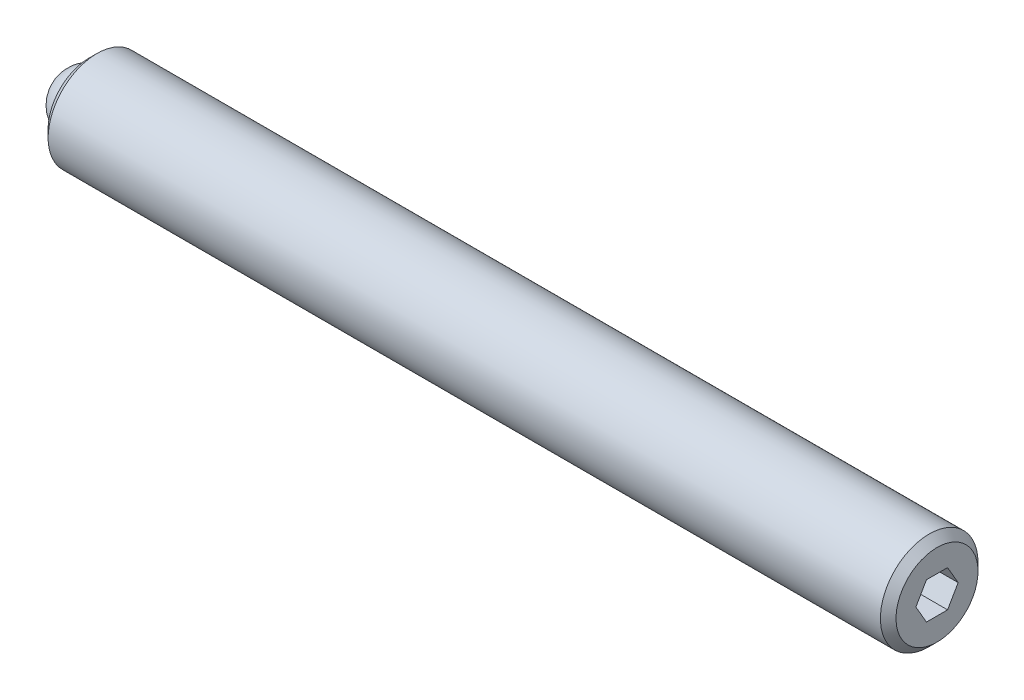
ISO-10303-21;
HEADER;
FILE_DESCRIPTION(('STEP AP214'),'2;1');
FILE_NAME('part.step','',(''),(''),'','','');
FILE_SCHEMA(('AUTOMOTIVE_DESIGN { 1 0 10303 214 1 1 1 1 }'));
ENDSEC;
DATA;
#1=APPLICATION_CONTEXT('core data for automotive mechanical design processes');
#2=APPLICATION_PROTOCOL_DEFINITION('international standard','automotive_design',2000,#1);
#3=PRODUCT_CONTEXT('',#1,'mechanical');
#4=PRODUCT('Part','Part','',(#3));
#5=PRODUCT_RELATED_PRODUCT_CATEGORY('part','',(#4));
#6=PRODUCT_DEFINITION_FORMATION('','',#4);
#7=PRODUCT_DEFINITION_CONTEXT('part definition',#1,'design');
#8=PRODUCT_DEFINITION('design','',#6,#7);
#9=PRODUCT_DEFINITION_SHAPE('','',#8);
#10=(LENGTH_UNIT() NAMED_UNIT(*) SI_UNIT(.MILLI.,.METRE.));
#11=(NAMED_UNIT(*) PLANE_ANGLE_UNIT() SI_UNIT($,.RADIAN.));
#12=(NAMED_UNIT(*) SI_UNIT($,.STERADIAN.) SOLID_ANGLE_UNIT());
#13=UNCERTAINTY_MEASURE_WITH_UNIT(LENGTH_MEASURE(1.E-05),#10,'distance_accuracy_value','');
#14=(GEOMETRIC_REPRESENTATION_CONTEXT(3) GLOBAL_UNCERTAINTY_ASSIGNED_CONTEXT((#13)) GLOBAL_UNIT_ASSIGNED_CONTEXT((#10,
#11,#12)) REPRESENTATION_CONTEXT('',''));
#15=CARTESIAN_POINT('',(0.,0.,0.));
#16=DIRECTION('',(0.,0.,1.));
#17=DIRECTION('',(1.,0.,0.));
#18=AXIS2_PLACEMENT_3D('',#15,#16,#17);
#19=CARTESIAN_POINT('',(0.,0.,0.));
#20=DIRECTION('',(0.,-1.,0.));
#21=DIRECTION('',(0.,0.,1.));
#22=AXIS2_PLACEMENT_3D('',#19,#20,#21);
#23=SPHERICAL_SURFACE('',#22,1.984375);
#24=CARTESIAN_POINT('',(0.,-1.984375,0.));
#25=VERTEX_POINT('',#24);
#26=VERTEX_LOOP('',#25);
#27=FACE_BOUND('',#26,.T.);
#28=ADVANCED_FACE('F41',(#27),#23,.T.);
#29=CLOSED_SHELL('',(#28));
#30=MANIFOLD_SOLID_BREP('B2',#29);
#31=CARTESIAN_POINT('',(55.165625,0.,0.));
#32=DIRECTION('',(-1.,0.,0.));
#33=DIRECTION('',(0.,0.,1.));
#34=AXIS2_PLACEMENT_3D('',#31,#32,#33);
#35=CYLINDRICAL_SURFACE('',#34,3.175);
#36=CARTESIAN_POINT('',(54.657625,0.,0.));
#37=DIRECTION('',(1.,0.,0.));
#38=DIRECTION('',(0.,0.,-1.));
#39=AXIS2_PLACEMENT_3D('',#36,#37,#38);
#40=CIRCLE('',#39,3.175);
#41=CARTESIAN_POINT('',(54.657625,0.,-3.175));
#42=VERTEX_POINT('',#41);
#43=EDGE_CURVE('E39',#42,#42,#40,.F.);
#44=ORIENTED_EDGE('',*,*,#43,.T.);
#45=EDGE_LOOP('',(#44));
#46=FACE_BOUND('',#45,.T.);
#47=CARTESIAN_POINT('',(0.507999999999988,0.,0.));
#48=DIRECTION('',(1.,0.,0.));
#49=DIRECTION('',(0.,0.,-1.));
#50=AXIS2_PLACEMENT_3D('',#47,#48,#49);
#51=CIRCLE('',#50,3.175);
#52=CARTESIAN_POINT('',(0.507999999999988,0.,-3.175));
#53=VERTEX_POINT('',#52);
#54=EDGE_CURVE('E157',#53,#53,#51,.T.);
#55=ORIENTED_EDGE('',*,*,#54,.T.);
#56=EDGE_LOOP('',(#55));
#57=FACE_BOUND('',#56,.T.);
#58=ADVANCED_FACE('F54',(#46,#57),#35,.T.);
#59=CARTESIAN_POINT('',(55.165625,0.,0.));
#60=DIRECTION('',(1.,0.,0.));
#61=DIRECTION('',(0.,0.,-1.));
#62=AXIS2_PLACEMENT_3D('',#59,#60,#61);
#63=PLANE('',#62);
#64=DIRECTION('',(0.,0.866025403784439,-0.5));
#65=VECTOR('',#64,1.);
#66=CARTESIAN_POINT('',(55.165625,-1.190625,-0.687407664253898));
#67=LINE('',#66,#65);
#68=CARTESIAN_POINT('',(55.165625,-1.190625,-0.687407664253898));
#69=VERTEX_POINT('',#68);
#70=CARTESIAN_POINT('',(55.165625,0.,-1.3748153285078));
#71=VERTEX_POINT('',#70);
#72=EDGE_CURVE('E69',#69,#71,#67,.T.);
#73=ORIENTED_EDGE('',*,*,#72,.F.);
#74=DIRECTION('',(0.,0.,-1.));
#75=VECTOR('',#74,1.);
#76=CARTESIAN_POINT('',(55.165625,-1.190625,0.687407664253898));
#77=LINE('',#76,#75);
#78=CARTESIAN_POINT('',(55.165625,-1.190625,0.687407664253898));
#79=VERTEX_POINT('',#78);
#80=EDGE_CURVE('E153',#79,#69,#77,.T.);
#81=ORIENTED_EDGE('',*,*,#80,.F.);
#82=DIRECTION('',(0.,-0.866025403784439,-0.5));
#83=VECTOR('',#82,1.);
#84=CARTESIAN_POINT('',(55.165625,0.,1.3748153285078));
#85=LINE('',#84,#83);
#86=CARTESIAN_POINT('',(55.165625,0.,1.3748153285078));
#87=VERTEX_POINT('',#86);
#88=EDGE_CURVE('E151',#87,#79,#85,.T.);
#89=ORIENTED_EDGE('',*,*,#88,.F.);
#90=DIRECTION('',(0.,-0.866025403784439,0.5));
#91=VECTOR('',#90,1.);
#92=CARTESIAN_POINT('',(55.165625,1.190625,0.687407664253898));
#93=LINE('',#92,#91);
#94=CARTESIAN_POINT('',(55.165625,1.190625,0.687407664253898));
#95=VERTEX_POINT('',#94);
#96=EDGE_CURVE('E117',#95,#87,#93,.T.);
#97=ORIENTED_EDGE('',*,*,#96,.F.);
#98=DIRECTION('',(0.,0.,1.));
#99=VECTOR('',#98,1.);
#100=CARTESIAN_POINT('',(55.165625,1.190625,-0.687407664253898));
#101=LINE('',#100,#99);
#102=CARTESIAN_POINT('',(55.165625,1.190625,-0.687407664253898));
#103=VERTEX_POINT('',#102);
#104=EDGE_CURVE('E147',#103,#95,#101,.T.);
#105=ORIENTED_EDGE('',*,*,#104,.F.);
#106=DIRECTION('',(0.,0.866025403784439,0.5));
#107=VECTOR('',#106,1.);
#108=CARTESIAN_POINT('',(55.165625,0.,-1.3748153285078));
#109=LINE('',#108,#107);
#110=EDGE_CURVE('E143',#71,#103,#109,.T.);
#111=ORIENTED_EDGE('',*,*,#110,.F.);
#112=EDGE_LOOP('',(#73,#81,#89,#97,#105,#111));
#113=FACE_BOUND('',#112,.T.);
#114=CARTESIAN_POINT('',(55.165625,0.,0.));
#115=DIRECTION('',(1.,0.,0.));
#116=DIRECTION('',(0.,0.,-1.));
#117=AXIS2_PLACEMENT_3D('',#114,#115,#116);
#118=CIRCLE('',#117,2.667);
#119=CARTESIAN_POINT('',(55.165625,0.,-2.667));
#120=VERTEX_POINT('',#119);
#121=EDGE_CURVE('E62',#120,#120,#118,.T.);
#122=ORIENTED_EDGE('',*,*,#121,.T.);
#123=EDGE_LOOP('',(#122));
#124=FACE_BOUND('',#123,.T.);
#125=ADVANCED_FACE('F170',(#113,#124),#63,.T.);
#126=CARTESIAN_POINT('',(0.,0.,0.));
#127=DIRECTION('',(1.,0.,0.));
#128=DIRECTION('',(0.,0.,-1.));
#129=AXIS2_PLACEMENT_3D('',#126,#127,#128);
#130=PLANE('',#129);
#131=CARTESIAN_POINT('',(0.,0.,0.));
#132=DIRECTION('',(-1.,0.,0.));
#133=DIRECTION('',(0.,0.,1.));
#134=AXIS2_PLACEMENT_3D('',#131,#132,#133);
#135=CIRCLE('',#134,1.9812);
#136=CARTESIAN_POINT('',(0.,0.,1.9812));
#137=VERTEX_POINT('',#136);
#138=EDGE_CURVE('E225',#137,#137,#135,.T.);
#139=ORIENTED_EDGE('',*,*,#138,.F.);
#140=EDGE_LOOP('',(#139));
#141=FACE_BOUND('',#140,.T.);
#142=CARTESIAN_POINT('',(0.,0.,0.));
#143=DIRECTION('',(1.,0.,0.));
#144=DIRECTION('',(0.,0.,-1.));
#145=AXIS2_PLACEMENT_3D('',#142,#143,#144);
#146=CIRCLE('',#145,2.66700000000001);
#147=CARTESIAN_POINT('',(0.,0.,-2.66700000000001));
#148=VERTEX_POINT('',#147);
#149=EDGE_CURVE('E165',#148,#148,#146,.F.);
#150=ORIENTED_EDGE('',*,*,#149,.T.);
#151=EDGE_LOOP('',(#150));
#152=FACE_BOUND('',#151,.T.);
#153=ADVANCED_FACE('F182',(#141,#152),#130,.F.);
#154=CARTESIAN_POINT('',(0.507999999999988,0.,0.));
#155=DIRECTION('',(1.,0.,0.));
#156=DIRECTION('',(0.,0.,-1.));
#157=AXIS2_PLACEMENT_3D('',#154,#155,#156);
#158=CONICAL_SURFACE('',#157,3.175,0.78539816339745);
#159=ORIENTED_EDGE('',*,*,#149,.F.);
#160=EDGE_LOOP('',(#159));
#161=FACE_BOUND('',#160,.T.);
#162=ORIENTED_EDGE('',*,*,#54,.F.);
#163=EDGE_LOOP('',(#162));
#164=FACE_BOUND('',#163,.T.);
#165=ADVANCED_FACE('F174',(#161,#164),#158,.T.);
#166=CARTESIAN_POINT('',(55.165625,0.,0.));
#167=DIRECTION('',(-1.,0.,0.));
#168=DIRECTION('',(0.,0.,1.));
#169=AXIS2_PLACEMENT_3D('',#166,#167,#168);
#170=CONICAL_SURFACE('',#169,2.667,0.785398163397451);
#171=ORIENTED_EDGE('',*,*,#43,.F.);
#172=EDGE_LOOP('',(#171));
#173=FACE_BOUND('',#172,.T.);
#174=ORIENTED_EDGE('',*,*,#121,.F.);
#175=EDGE_LOOP('',(#174));
#176=FACE_BOUND('',#175,.T.);
#177=ADVANCED_FACE('F56',(#173,#176),#170,.T.);
#178=CARTESIAN_POINT('',(52.879625,-1.190625,-0.687407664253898));
#179=DIRECTION('',(0.,-0.5,-0.866025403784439));
#180=DIRECTION('',(0.,0.866025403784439,-0.5));
#181=AXIS2_PLACEMENT_3D('',#178,#179,#180);
#182=PLANE('',#181);
#183=ORIENTED_EDGE('',*,*,#72,.T.);
#184=DIRECTION('',(1.,0.,0.));
#185=VECTOR('',#184,1.);
#186=CARTESIAN_POINT('',(52.879625,0.,-1.3748153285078));
#187=LINE('',#186,#185);
#188=CARTESIAN_POINT('',(52.879625,0.,-1.3748153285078));
#189=VERTEX_POINT('',#188);
#190=EDGE_CURVE('E99',#189,#71,#187,.T.);
#191=ORIENTED_EDGE('',*,*,#190,.F.);
#192=DIRECTION('',(0.,0.866025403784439,-0.5));
#193=VECTOR('',#192,1.);
#194=CARTESIAN_POINT('',(52.879625,-1.190625,-0.687407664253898));
#195=LINE('',#194,#193);
#196=CARTESIAN_POINT('',(52.879625,-1.190625,-0.687407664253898));
#197=VERTEX_POINT('',#196);
#198=EDGE_CURVE('E155',#197,#189,#195,.T.);
#199=ORIENTED_EDGE('',*,*,#198,.F.);
#200=DIRECTION('',(1.,0.,0.));
#201=VECTOR('',#200,1.);
#202=CARTESIAN_POINT('',(52.879625,-1.190625,-0.687407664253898));
#203=LINE('',#202,#201);
#204=EDGE_CURVE('E77',#197,#69,#203,.T.);
#205=ORIENTED_EDGE('',*,*,#204,.T.);
#206=EDGE_LOOP('',(#183,#191,#199,#205));
#207=FACE_BOUND('',#206,.T.);
#208=ADVANCED_FACE('F173',(#207),#182,.F.);
#209=CARTESIAN_POINT('',(52.879625,-1.190625,0.687407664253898));
#210=DIRECTION('',(0.,-1.,0.));
#211=DIRECTION('',(0.,0.,-1.));
#212=AXIS2_PLACEMENT_3D('',#209,#210,#211);
#213=PLANE('',#212);
#214=ORIENTED_EDGE('',*,*,#80,.T.);
#215=ORIENTED_EDGE('',*,*,#204,.F.);
#216=DIRECTION('',(0.,0.,-1.));
#217=VECTOR('',#216,1.);
#218=CARTESIAN_POINT('',(52.879625,-1.190625,0.687407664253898));
#219=LINE('',#218,#217);
#220=CARTESIAN_POINT('',(52.879625,-1.190625,0.687407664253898));
#221=VERTEX_POINT('',#220);
#222=EDGE_CURVE('E129',#221,#197,#219,.T.);
#223=ORIENTED_EDGE('',*,*,#222,.F.);
#224=DIRECTION('',(1.,0.,0.));
#225=VECTOR('',#224,1.);
#226=CARTESIAN_POINT('',(52.879625,-1.190625,0.687407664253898));
#227=LINE('',#226,#225);
#228=EDGE_CURVE('E121',#221,#79,#227,.T.);
#229=ORIENTED_EDGE('',*,*,#228,.T.);
#230=EDGE_LOOP('',(#214,#215,#223,#229));
#231=FACE_BOUND('',#230,.T.);
#232=ADVANCED_FACE('F180',(#231),#213,.F.);
#233=CARTESIAN_POINT('',(52.879625,0.,1.3748153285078));
#234=DIRECTION('',(0.,-0.5,0.866025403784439));
#235=DIRECTION('',(0.,-0.866025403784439,-0.5));
#236=AXIS2_PLACEMENT_3D('',#233,#234,#235);
#237=PLANE('',#236);
#238=ORIENTED_EDGE('',*,*,#88,.T.);
#239=ORIENTED_EDGE('',*,*,#228,.F.);
#240=DIRECTION('',(0.,-0.866025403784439,-0.5));
#241=VECTOR('',#240,1.);
#242=CARTESIAN_POINT('',(52.879625,0.,1.3748153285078));
#243=LINE('',#242,#241);
#244=CARTESIAN_POINT('',(52.879625,0.,1.3748153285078));
#245=VERTEX_POINT('',#244);
#246=EDGE_CURVE('E125',#245,#221,#243,.T.);
#247=ORIENTED_EDGE('',*,*,#246,.F.);
#248=DIRECTION('',(1.,0.,0.));
#249=VECTOR('',#248,1.);
#250=CARTESIAN_POINT('',(52.879625,0.,1.3748153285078));
#251=LINE('',#250,#249);
#252=EDGE_CURVE('E110',#245,#87,#251,.T.);
#253=ORIENTED_EDGE('',*,*,#252,.T.);
#254=EDGE_LOOP('',(#238,#239,#247,#253));
#255=FACE_BOUND('',#254,.T.);
#256=ADVANCED_FACE('F126',(#255),#237,.F.);
#257=CARTESIAN_POINT('',(52.879625,1.190625,0.687407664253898));
#258=DIRECTION('',(0.,0.5,0.866025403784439));
#259=DIRECTION('',(0.,-0.866025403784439,0.5));
#260=AXIS2_PLACEMENT_3D('',#257,#258,#259);
#261=PLANE('',#260);
#262=ORIENTED_EDGE('',*,*,#96,.T.);
#263=ORIENTED_EDGE('',*,*,#252,.F.);
#264=DIRECTION('',(0.,-0.866025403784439,0.5));
#265=VECTOR('',#264,1.);
#266=CARTESIAN_POINT('',(52.879625,1.190625,0.687407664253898));
#267=LINE('',#266,#265);
#268=CARTESIAN_POINT('',(52.879625,1.190625,0.687407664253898));
#269=VERTEX_POINT('',#268);
#270=EDGE_CURVE('E114',#269,#245,#267,.T.);
#271=ORIENTED_EDGE('',*,*,#270,.F.);
#272=DIRECTION('',(1.,0.,0.));
#273=VECTOR('',#272,1.);
#274=CARTESIAN_POINT('',(52.879625,1.190625,0.687407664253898));
#275=LINE('',#274,#273);
#276=EDGE_CURVE('E122',#269,#95,#275,.T.);
#277=ORIENTED_EDGE('',*,*,#276,.T.);
#278=EDGE_LOOP('',(#262,#263,#271,#277));
#279=FACE_BOUND('',#278,.T.);
#280=ADVANCED_FACE('F112',(#279),#261,.F.);
#281=CARTESIAN_POINT('',(52.879625,1.190625,-0.687407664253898));
#282=DIRECTION('',(0.,1.,0.));
#283=DIRECTION('',(0.,0.,1.));
#284=AXIS2_PLACEMENT_3D('',#281,#282,#283);
#285=PLANE('',#284);
#286=ORIENTED_EDGE('',*,*,#104,.T.);
#287=ORIENTED_EDGE('',*,*,#276,.F.);
#288=DIRECTION('',(0.,0.,1.));
#289=VECTOR('',#288,1.);
#290=CARTESIAN_POINT('',(52.879625,1.190625,-0.687407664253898));
#291=LINE('',#290,#289);
#292=CARTESIAN_POINT('',(52.879625,1.190625,-0.687407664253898));
#293=VERTEX_POINT('',#292);
#294=EDGE_CURVE('E135',#293,#269,#291,.T.);
#295=ORIENTED_EDGE('',*,*,#294,.F.);
#296=DIRECTION('',(1.,0.,0.));
#297=VECTOR('',#296,1.);
#298=CARTESIAN_POINT('',(52.879625,1.190625,-0.687407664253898));
#299=LINE('',#298,#297);
#300=EDGE_CURVE('E160',#293,#103,#299,.T.);
#301=ORIENTED_EDGE('',*,*,#300,.T.);
#302=EDGE_LOOP('',(#286,#287,#295,#301));
#303=FACE_BOUND('',#302,.T.);
#304=ADVANCED_FACE('F201',(#303),#285,.F.);
#305=CARTESIAN_POINT('',(52.879625,0.,-1.3748153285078));
#306=DIRECTION('',(0.,0.5,-0.866025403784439));
#307=DIRECTION('',(0.,0.866025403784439,0.5));
#308=AXIS2_PLACEMENT_3D('',#305,#306,#307);
#309=PLANE('',#308);
#310=ORIENTED_EDGE('',*,*,#110,.T.);
#311=ORIENTED_EDGE('',*,*,#300,.F.);
#312=DIRECTION('',(0.,0.866025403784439,0.5));
#313=VECTOR('',#312,1.);
#314=CARTESIAN_POINT('',(52.879625,0.,-1.3748153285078));
#315=LINE('',#314,#313);
#316=EDGE_CURVE('E137',#189,#293,#315,.T.);
#317=ORIENTED_EDGE('',*,*,#316,.F.);
#318=ORIENTED_EDGE('',*,*,#190,.T.);
#319=EDGE_LOOP('',(#310,#311,#317,#318));
#320=FACE_BOUND('',#319,.T.);
#321=ADVANCED_FACE('F198',(#320),#309,.F.);
#322=CARTESIAN_POINT('',(52.879625,0.,0.));
#323=DIRECTION('',(1.,0.,0.));
#324=DIRECTION('',(0.,0.,-1.));
#325=AXIS2_PLACEMENT_3D('',#322,#323,#324);
#326=PLANE('',#325);
#327=ORIENTED_EDGE('',*,*,#198,.T.);
#328=ORIENTED_EDGE('',*,*,#316,.T.);
#329=ORIENTED_EDGE('',*,*,#294,.T.);
#330=ORIENTED_EDGE('',*,*,#270,.T.);
#331=ORIENTED_EDGE('',*,*,#246,.T.);
#332=ORIENTED_EDGE('',*,*,#222,.T.);
#333=EDGE_LOOP('',(#327,#328,#329,#330,#331,#332));
#334=FACE_BOUND('',#333,.T.);
#335=ADVANCED_FACE('F132',(#334),#326,.T.);
#336=CARTESIAN_POINT('',(1.984375,0.,0.));
#337=DIRECTION('',(-1.,0.,0.));
#338=DIRECTION('',(0.,0.,1.));
#339=AXIS2_PLACEMENT_3D('',#336,#337,#338);
#340=CYLINDRICAL_SURFACE('',#339,1.9812);
#341=CARTESIAN_POINT('',(1.984375,0.,0.));
#342=DIRECTION('',(-1.,0.,0.));
#343=DIRECTION('',(0.,0.,1.));
#344=AXIS2_PLACEMENT_3D('',#341,#342,#343);
#345=CIRCLE('',#344,1.9812);
#346=CARTESIAN_POINT('',(1.984375,0.,1.9812));
#347=VERTEX_POINT('',#346);
#348=EDGE_CURVE('E144',#347,#347,#345,.T.);
#349=ORIENTED_EDGE('',*,*,#348,.F.);
#350=EDGE_LOOP('',(#349));
#351=FACE_BOUND('',#350,.T.);
#352=ORIENTED_EDGE('',*,*,#138,.T.);
#353=EDGE_LOOP('',(#352));
#354=FACE_BOUND('',#353,.T.);
#355=ADVANCED_FACE('F214',(#351,#354),#340,.F.);
#356=CARTESIAN_POINT('',(1.984375,0.,0.));
#357=DIRECTION('',(-1.,0.,0.));
#358=DIRECTION('',(0.,0.,1.));
#359=AXIS2_PLACEMENT_3D('',#356,#357,#358);
#360=PLANE('',#359);
#361=ORIENTED_EDGE('',*,*,#348,.T.);
#362=EDGE_LOOP('',(#361));
#363=FACE_BOUND('',#362,.T.);
#364=ADVANCED_FACE('F217',(#363),#360,.T.);
#365=CLOSED_SHELL('',(#58,#125,#153,#165,#177,#208,#232,#256,#280,#304,#321,#335,#355,#364));
#366=MANIFOLD_SOLID_BREP('B6',#365);
#367=ADVANCED_BREP_SHAPE_REPRESENTATION('',(#18,#30,#366),#14);
#368=SHAPE_DEFINITION_REPRESENTATION(#9,#367);
ENDSEC;
END-ISO-10303-21;
